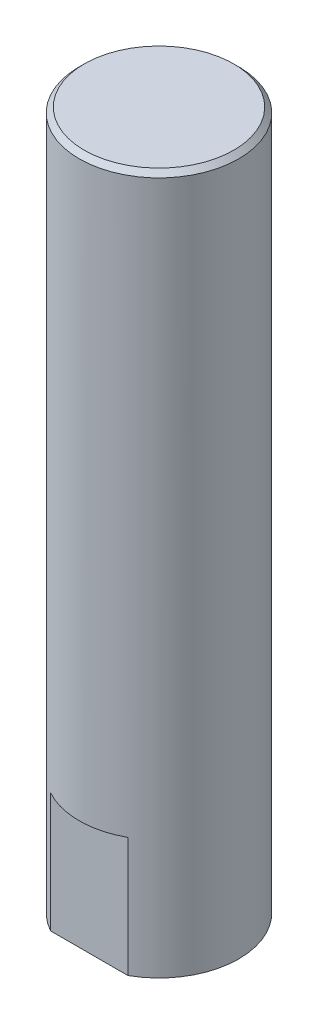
ISO-10303-21;
HEADER;
FILE_DESCRIPTION(('STEP AP214'),'2;1');
FILE_NAME('part.step','',(''),(''),'','','');
FILE_SCHEMA(('AUTOMOTIVE_DESIGN { 1 0 10303 214 1 1 1 1 }'));
ENDSEC;
DATA;
#1=APPLICATION_CONTEXT('core data for automotive mechanical design processes');
#2=APPLICATION_PROTOCOL_DEFINITION('international standard','automotive_design',2000,#1);
#3=PRODUCT_CONTEXT('',#1,'mechanical');
#4=PRODUCT('Part','Part','',(#3));
#5=PRODUCT_RELATED_PRODUCT_CATEGORY('part','',(#4));
#6=PRODUCT_DEFINITION_FORMATION('','',#4);
#7=PRODUCT_DEFINITION_CONTEXT('part definition',#1,'design');
#8=PRODUCT_DEFINITION('design','',#6,#7);
#9=PRODUCT_DEFINITION_SHAPE('','',#8);
#10=(LENGTH_UNIT() NAMED_UNIT(*) SI_UNIT(.MILLI.,.METRE.));
#11=(NAMED_UNIT(*) PLANE_ANGLE_UNIT() SI_UNIT($,.RADIAN.));
#12=(NAMED_UNIT(*) SI_UNIT($,.STERADIAN.) SOLID_ANGLE_UNIT());
#13=UNCERTAINTY_MEASURE_WITH_UNIT(LENGTH_MEASURE(1.E-05),#10,'distance_accuracy_value','');
#14=(GEOMETRIC_REPRESENTATION_CONTEXT(3) GLOBAL_UNCERTAINTY_ASSIGNED_CONTEXT((#13)) GLOBAL_UNIT_ASSIGNED_CONTEXT((#10,
#11,#12)) REPRESENTATION_CONTEXT('',''));
#15=CARTESIAN_POINT('',(0.,0.,0.));
#16=DIRECTION('',(0.,0.,1.));
#17=DIRECTION('',(1.,0.,0.));
#18=AXIS2_PLACEMENT_3D('',#15,#16,#17);
#19=CARTESIAN_POINT('',(0.,0.,0.));
#20=DIRECTION('',(0.,-1.,0.));
#21=DIRECTION('',(0.,0.,-1.));
#22=AXIS2_PLACEMENT_3D('',#19,#20,#21);
#23=PLANE('',#22);
#24=DIRECTION('',(-1.,0.,0.));
#25=VECTOR('',#24,1.);
#26=CARTESIAN_POINT('',(-5.72894877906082,0.,-7.));
#27=LINE('',#26,#25);
#28=CARTESIAN_POINT('',(3.87298334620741,0.,-7.));
#29=VERTEX_POINT('',#28);
#30=CARTESIAN_POINT('',(-3.87298334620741,0.,-7.));
#31=VERTEX_POINT('',#30);
#32=EDGE_CURVE('E62',#29,#31,#27,.T.);
#33=ORIENTED_EDGE('',*,*,#32,.F.);
#34=CARTESIAN_POINT('',(0.,0.,0.));
#35=DIRECTION('',(0.,-1.,0.));
#36=DIRECTION('',(0.,0.,-1.));
#37=AXIS2_PLACEMENT_3D('',#34,#35,#36);
#38=CIRCLE('',#37,8.);
#39=CARTESIAN_POINT('',(3.87298334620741,0.,7.));
#40=VERTEX_POINT('',#39);
#41=EDGE_CURVE('E74',#29,#40,#38,.T.);
#42=ORIENTED_EDGE('',*,*,#41,.T.);
#43=DIRECTION('',(1.,0.,0.));
#44=VECTOR('',#43,1.);
#45=CARTESIAN_POINT('',(-5.72894877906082,0.,7.));
#46=LINE('',#45,#44);
#47=CARTESIAN_POINT('',(-3.87298334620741,0.,7.));
#48=VERTEX_POINT('',#47);
#49=EDGE_CURVE('E199',#48,#40,#46,.T.);
#50=ORIENTED_EDGE('',*,*,#49,.F.);
#51=EDGE_CURVE('E77',#48,#31,#38,.T.);
#52=ORIENTED_EDGE('',*,*,#51,.T.);
#53=EDGE_LOOP('',(#33,#42,#50,#52));
#54=FACE_BOUND('',#53,.T.);
#55=CARTESIAN_POINT('',(0.,0.,0.));
#56=DIRECTION('',(0.,-1.,0.));
#57=DIRECTION('',(0.,0.,-1.));
#58=AXIS2_PLACEMENT_3D('',#55,#56,#57);
#59=CIRCLE('',#58,4.4);
#60=CARTESIAN_POINT('',(0.,0.,-4.4));
#61=VERTEX_POINT('',#60);
#62=EDGE_CURVE('E87',#61,#61,#59,.T.);
#63=ORIENTED_EDGE('',*,*,#62,.F.);
#64=EDGE_LOOP('',(#63));
#65=FACE_BOUND('',#64,.T.);
#66=ADVANCED_FACE('F16',(#54,#65),#23,.T.);
#67=CARTESIAN_POINT('',(0.,0.,0.));
#68=DIRECTION('',(0.,-1.,0.));
#69=DIRECTION('',(0.,0.,-1.));
#70=AXIS2_PLACEMENT_3D('',#67,#68,#69);
#71=CYLINDRICAL_SURFACE('',#70,8.);
#72=CARTESIAN_POINT('',(0.,69.5,0.));
#73=DIRECTION('',(0.,1.,0.));
#74=DIRECTION('',(0.,0.,1.));
#75=AXIS2_PLACEMENT_3D('',#72,#73,#74);
#76=CIRCLE('',#75,8.);
#77=CARTESIAN_POINT('',(0.,69.5,8.));
#78=VERTEX_POINT('',#77);
#79=EDGE_CURVE('E24',#78,#78,#76,.F.);
#80=ORIENTED_EDGE('',*,*,#79,.T.);
#81=EDGE_LOOP('',(#80));
#82=FACE_BOUND('',#81,.T.);
#83=DIRECTION('',(0.,-1.,0.));
#84=VECTOR('',#83,1.);
#85=CARTESIAN_POINT('',(-3.87298334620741,0.,-7.));
#86=LINE('',#85,#84);
#87=CARTESIAN_POINT('',(-3.87298334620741,12.,-7.));
#88=VERTEX_POINT('',#87);
#89=EDGE_CURVE('E67',#31,#88,#86,.F.);
#90=ORIENTED_EDGE('',*,*,#89,.F.);
#91=ORIENTED_EDGE('',*,*,#51,.F.);
#92=DIRECTION('',(0.,-1.,0.));
#93=VECTOR('',#92,1.);
#94=CARTESIAN_POINT('',(-3.87298334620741,0.,7.));
#95=LINE('',#94,#93);
#96=CARTESIAN_POINT('',(-3.87298334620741,12.,7.));
#97=VERTEX_POINT('',#96);
#98=EDGE_CURVE('E92',#97,#48,#95,.T.);
#99=ORIENTED_EDGE('',*,*,#98,.F.);
#100=CARTESIAN_POINT('',(0.,12.,0.));
#101=DIRECTION('',(0.,-1.,0.));
#102=DIRECTION('',(0.,0.,-1.));
#103=AXIS2_PLACEMENT_3D('',#100,#101,#102);
#104=CIRCLE('',#103,8.);
#105=CARTESIAN_POINT('',(3.87298334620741,12.,7.));
#106=VERTEX_POINT('',#105);
#107=EDGE_CURVE('E85',#97,#106,#104,.F.);
#108=ORIENTED_EDGE('',*,*,#107,.T.);
#109=DIRECTION('',(0.,-1.,0.));
#110=VECTOR('',#109,1.);
#111=CARTESIAN_POINT('',(3.87298334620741,0.,7.));
#112=LINE('',#111,#110);
#113=EDGE_CURVE('E82',#40,#106,#112,.F.);
#114=ORIENTED_EDGE('',*,*,#113,.F.);
#115=ORIENTED_EDGE('',*,*,#41,.F.);
#116=DIRECTION('',(0.,-1.,0.));
#117=VECTOR('',#116,1.);
#118=CARTESIAN_POINT('',(3.87298334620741,0.,-7.));
#119=LINE('',#118,#117);
#120=CARTESIAN_POINT('',(3.87298334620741,12.,-7.));
#121=VERTEX_POINT('',#120);
#122=EDGE_CURVE('E59',#121,#29,#119,.T.);
#123=ORIENTED_EDGE('',*,*,#122,.F.);
#124=CARTESIAN_POINT('',(0.,12.,0.));
#125=DIRECTION('',(0.,-1.,0.));
#126=DIRECTION('',(0.,0.,-1.));
#127=AXIS2_PLACEMENT_3D('',#124,#125,#126);
#128=CIRCLE('',#127,8.);
#129=EDGE_CURVE('E68',#121,#88,#128,.F.);
#130=ORIENTED_EDGE('',*,*,#129,.T.);
#131=EDGE_LOOP('',(#90,#91,#99,#108,#114,#115,#123,#130));
#132=FACE_BOUND('',#131,.T.);
#133=ADVANCED_FACE('F80',(#82,#132),#71,.T.);
#134=CARTESIAN_POINT('',(8.,70.,0.));
#135=DIRECTION('',(0.,1.,0.));
#136=DIRECTION('',(0.,0.,1.));
#137=AXIS2_PLACEMENT_3D('',#134,#135,#136);
#138=PLANE('',#137);
#139=CARTESIAN_POINT('',(0.,70.,0.));
#140=DIRECTION('',(0.,1.,0.));
#141=DIRECTION('',(0.,0.,1.));
#142=AXIS2_PLACEMENT_3D('',#139,#140,#141);
#143=CIRCLE('',#142,7.5);
#144=CARTESIAN_POINT('',(0.,70.,7.5));
#145=VERTEX_POINT('',#144);
#146=EDGE_CURVE('E11',#145,#145,#143,.T.);
#147=ORIENTED_EDGE('',*,*,#146,.T.);
#148=EDGE_LOOP('',(#147));
#149=FACE_BOUND('',#148,.T.);
#150=ADVANCED_FACE('F115',(#149),#138,.T.);
#151=CARTESIAN_POINT('',(0.,26.25,0.));
#152=DIRECTION('',(0.,-1.,0.));
#153=DIRECTION('',(0.,0.,-1.));
#154=AXIS2_PLACEMENT_3D('',#151,#152,#153);
#155=CONICAL_SURFACE('',#154,4.4,1.02974425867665);
#156=CARTESIAN_POINT('',(0.,28.8937867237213,0.));
#157=VERTEX_POINT('',#156);
#158=VERTEX_LOOP('',#157);
#159=FACE_BOUND('',#158,.T.);
#160=CARTESIAN_POINT('',(0.,26.25,0.));
#161=DIRECTION('',(0.,-1.,0.));
#162=DIRECTION('',(0.,0.,-1.));
#163=AXIS2_PLACEMENT_3D('',#160,#161,#162);
#164=CIRCLE('',#163,4.4);
#165=CARTESIAN_POINT('',(0.,26.25,-4.4));
#166=VERTEX_POINT('',#165);
#167=EDGE_CURVE('E83',#166,#166,#164,.T.);
#168=ORIENTED_EDGE('',*,*,#167,.T.);
#169=EDGE_LOOP('',(#168));
#170=FACE_BOUND('',#169,.T.);
#171=ADVANCED_FACE('F120',(#159,#170),#155,.F.);
#172=CARTESIAN_POINT('',(0.,0.,0.));
#173=DIRECTION('',(0.,-1.,0.));
#174=DIRECTION('',(0.,0.,-1.));
#175=AXIS2_PLACEMENT_3D('',#172,#173,#174);
#176=CYLINDRICAL_SURFACE('',#175,4.4);
#177=ORIENTED_EDGE('',*,*,#167,.F.);
#178=EDGE_LOOP('',(#177));
#179=FACE_BOUND('',#178,.T.);
#180=ORIENTED_EDGE('',*,*,#62,.T.);
#181=EDGE_LOOP('',(#180));
#182=FACE_BOUND('',#181,.T.);
#183=ADVANCED_FACE('F124',(#179,#182),#176,.F.);
#184=CARTESIAN_POINT('',(-5.72894877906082,12.,7.));
#185=DIRECTION('',(0.,0.,-1.));
#186=DIRECTION('',(-1.,0.,0.));
#187=AXIS2_PLACEMENT_3D('',#184,#185,#186);
#188=PLANE('',#187);
#189=ORIENTED_EDGE('',*,*,#113,.T.);
#190=DIRECTION('',(1.,0.,0.));
#191=VECTOR('',#190,1.);
#192=CARTESIAN_POINT('',(-5.72894877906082,12.,7.));
#193=LINE('',#192,#191);
#194=EDGE_CURVE('E37',#97,#106,#193,.T.);
#195=ORIENTED_EDGE('',*,*,#194,.F.);
#196=ORIENTED_EDGE('',*,*,#98,.T.);
#197=ORIENTED_EDGE('',*,*,#49,.T.);
#198=EDGE_LOOP('',(#189,#195,#196,#197));
#199=FACE_BOUND('',#198,.T.);
#200=ADVANCED_FACE('F128',(#199),#188,.F.);
#201=CARTESIAN_POINT('',(0.,12.,0.));
#202=DIRECTION('',(0.,-1.,0.));
#203=DIRECTION('',(0.,0.,-1.));
#204=AXIS2_PLACEMENT_3D('',#201,#202,#203);
#205=PLANE('',#204);
#206=ORIENTED_EDGE('',*,*,#194,.T.);
#207=ORIENTED_EDGE('',*,*,#107,.F.);
#208=EDGE_LOOP('',(#206,#207));
#209=FACE_BOUND('',#208,.T.);
#210=ADVANCED_FACE('F132',(#209),#205,.T.);
#211=CARTESIAN_POINT('',(-5.72894877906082,12.,-7.));
#212=DIRECTION('',(0.,0.,1.));
#213=DIRECTION('',(1.,0.,0.));
#214=AXIS2_PLACEMENT_3D('',#211,#212,#213);
#215=PLANE('',#214);
#216=ORIENTED_EDGE('',*,*,#89,.T.);
#217=DIRECTION('',(-1.,0.,0.));
#218=VECTOR('',#217,1.);
#219=CARTESIAN_POINT('',(-5.72894877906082,12.,-7.));
#220=LINE('',#219,#218);
#221=EDGE_CURVE('E30',#121,#88,#220,.T.);
#222=ORIENTED_EDGE('',*,*,#221,.F.);
#223=ORIENTED_EDGE('',*,*,#122,.T.);
#224=ORIENTED_EDGE('',*,*,#32,.T.);
#225=EDGE_LOOP('',(#216,#222,#223,#224));
#226=FACE_BOUND('',#225,.T.);
#227=ADVANCED_FACE('F61',(#226),#215,.F.);
#228=CARTESIAN_POINT('',(0.,12.,0.));
#229=DIRECTION('',(0.,-1.,0.));
#230=DIRECTION('',(0.,0.,-1.));
#231=AXIS2_PLACEMENT_3D('',#228,#229,#230);
#232=PLANE('',#231);
#233=ORIENTED_EDGE('',*,*,#221,.T.);
#234=ORIENTED_EDGE('',*,*,#129,.F.);
#235=EDGE_LOOP('',(#233,#234));
#236=FACE_BOUND('',#235,.T.);
#237=ADVANCED_FACE('F101',(#236),#232,.T.);
#238=CARTESIAN_POINT('',(0.,69.5,0.));
#239=DIRECTION('',(0.,-1.,0.));
#240=DIRECTION('',(0.,0.,-1.));
#241=AXIS2_PLACEMENT_3D('',#238,#239,#240);
#242=CONICAL_SURFACE('',#241,8.,0.785398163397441);
#243=ORIENTED_EDGE('',*,*,#146,.F.);
#244=EDGE_LOOP('',(#243));
#245=FACE_BOUND('',#244,.T.);
#246=ORIENTED_EDGE('',*,*,#79,.F.);
#247=EDGE_LOOP('',(#246));
#248=FACE_BOUND('',#247,.T.);
#249=ADVANCED_FACE('F18',(#245,#248),#242,.T.);
#250=CLOSED_SHELL('',(#66,#133,#150,#171,#183,#200,#210,#227,#237,#249));
#251=MANIFOLD_SOLID_BREP('B1',#250);
#252=ADVANCED_BREP_SHAPE_REPRESENTATION('',(#18,#251),#14);
#253=SHAPE_DEFINITION_REPRESENTATION(#9,#252);
ENDSEC;
END-ISO-10303-21;
